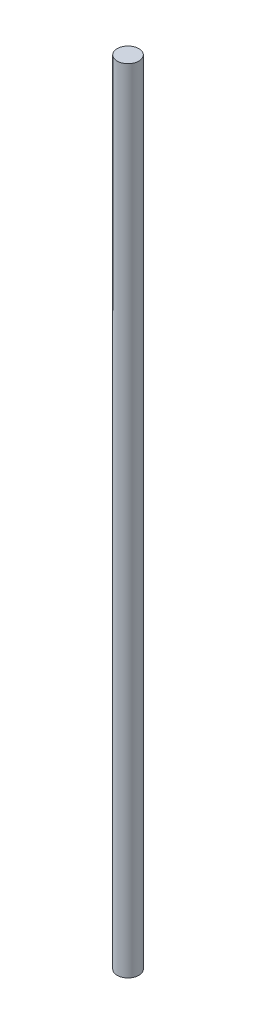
ISO-10303-21;
HEADER;
FILE_DESCRIPTION(('STEP AP214'),'2;1');
FILE_NAME('part.step','',(''),(''),'','','');
FILE_SCHEMA(('AUTOMOTIVE_DESIGN { 1 0 10303 214 1 1 1 1 }'));
ENDSEC;
DATA;
#1=APPLICATION_CONTEXT('core data for automotive mechanical design processes');
#2=APPLICATION_PROTOCOL_DEFINITION('international standard','automotive_design',2000,#1);
#3=PRODUCT_CONTEXT('',#1,'mechanical');
#4=PRODUCT('Part','Part','',(#3));
#5=PRODUCT_RELATED_PRODUCT_CATEGORY('part','',(#4));
#6=PRODUCT_DEFINITION_FORMATION('','',#4);
#7=PRODUCT_DEFINITION_CONTEXT('part definition',#1,'design');
#8=PRODUCT_DEFINITION('design','',#6,#7);
#9=PRODUCT_DEFINITION_SHAPE('','',#8);
#10=(LENGTH_UNIT() NAMED_UNIT(*) SI_UNIT(.MILLI.,.METRE.));
#11=(NAMED_UNIT(*) PLANE_ANGLE_UNIT() SI_UNIT($,.RADIAN.));
#12=(NAMED_UNIT(*) SI_UNIT($,.STERADIAN.) SOLID_ANGLE_UNIT());
#13=UNCERTAINTY_MEASURE_WITH_UNIT(LENGTH_MEASURE(1.E-05),#10,'distance_accuracy_value','');
#14=(GEOMETRIC_REPRESENTATION_CONTEXT(3) GLOBAL_UNCERTAINTY_ASSIGNED_CONTEXT((#13)) GLOBAL_UNIT_ASSIGNED_CONTEXT((#10,
#11,#12)) REPRESENTATION_CONTEXT('',''));
#15=CARTESIAN_POINT('',(0.,0.,0.));
#16=DIRECTION('',(0.,0.,1.));
#17=DIRECTION('',(1.,0.,0.));
#18=AXIS2_PLACEMENT_3D('',#15,#16,#17);
#19=CARTESIAN_POINT('',(0.,365.6,0.));
#20=DIRECTION('',(0.,-1.,0.));
#21=DIRECTION('',(0.,0.,-1.));
#22=AXIS2_PLACEMENT_3D('',#19,#20,#21);
#23=CYLINDRICAL_SURFACE('',#22,5.);
#24=CARTESIAN_POINT('',(0.,365.6,0.));
#25=DIRECTION('',(0.,1.,0.));
#26=DIRECTION('',(0.,0.,1.));
#27=AXIS2_PLACEMENT_3D('',#24,#25,#26);
#28=CIRCLE('',#27,5.);
#29=CARTESIAN_POINT('',(0.,365.6,-5.));
#30=VERTEX_POINT('',#29);
#31=EDGE_CURVE('E10',#30,#30,#28,.T.);
#32=CARTESIAN_POINT('',(0.,0.,0.));
#33=DIRECTION('',(0.,1.,0.));
#34=DIRECTION('',(0.,0.,1.));
#35=AXIS2_PLACEMENT_3D('',#32,#33,#34);
#36=CIRCLE('',#35,5.);
#37=CARTESIAN_POINT('',(0.,0.,-5.));
#38=VERTEX_POINT('',#37);
#39=EDGE_CURVE('E46',#38,#38,#36,.T.);
#40=CARTESIAN_POINT('',(0.,365.6,-5.));
#41=CARTESIAN_POINT('',(0.,361.791666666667,-5.));
#42=CARTESIAN_POINT('',(0.,357.983333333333,-5.));
#43=CARTESIAN_POINT('',(0.,350.366666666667,-5.));
#44=CARTESIAN_POINT('',(0.,346.558333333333,-5.));
#45=CARTESIAN_POINT('',(0.,338.941666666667,-5.));
#46=CARTESIAN_POINT('',(0.,335.133333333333,-5.));
#47=CARTESIAN_POINT('',(0.,327.516666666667,-5.));
#48=CARTESIAN_POINT('',(0.,323.708333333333,-5.));
#49=CARTESIAN_POINT('',(0.,316.091666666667,-5.));
#50=CARTESIAN_POINT('',(0.,312.283333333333,-5.));
#51=CARTESIAN_POINT('',(0.,304.666666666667,-5.));
#52=CARTESIAN_POINT('',(0.,300.858333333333,-5.));
#53=CARTESIAN_POINT('',(0.,293.241666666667,-5.));
#54=CARTESIAN_POINT('',(0.,289.433333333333,-5.));
#55=CARTESIAN_POINT('',(0.,281.816666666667,-5.));
#56=CARTESIAN_POINT('',(0.,278.008333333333,-5.));
#57=CARTESIAN_POINT('',(0.,270.391666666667,-5.));
#58=CARTESIAN_POINT('',(0.,266.583333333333,-5.));
#59=CARTESIAN_POINT('',(0.,258.966666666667,-5.));
#60=CARTESIAN_POINT('',(0.,255.158333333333,-5.));
#61=CARTESIAN_POINT('',(0.,247.541666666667,-5.));
#62=CARTESIAN_POINT('',(0.,243.733333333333,-5.));
#63=CARTESIAN_POINT('',(0.,236.116666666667,-5.));
#64=CARTESIAN_POINT('',(0.,232.308333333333,-5.));
#65=CARTESIAN_POINT('',(0.,224.691666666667,-5.));
#66=CARTESIAN_POINT('',(0.,220.883333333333,-5.));
#67=CARTESIAN_POINT('',(0.,213.266666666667,-5.));
#68=CARTESIAN_POINT('',(0.,209.458333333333,-5.));
#69=CARTESIAN_POINT('',(0.,201.841666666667,-5.));
#70=CARTESIAN_POINT('',(0.,198.033333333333,-5.));
#71=CARTESIAN_POINT('',(0.,190.416666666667,-5.));
#72=CARTESIAN_POINT('',(0.,186.608333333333,-5.));
#73=CARTESIAN_POINT('',(0.,178.991666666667,-5.));
#74=CARTESIAN_POINT('',(0.,175.183333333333,-5.));
#75=CARTESIAN_POINT('',(0.,167.566666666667,-5.));
#76=CARTESIAN_POINT('',(0.,163.758333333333,-5.));
#77=CARTESIAN_POINT('',(0.,156.141666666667,-5.));
#78=CARTESIAN_POINT('',(0.,152.333333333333,-5.));
#79=CARTESIAN_POINT('',(0.,144.716666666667,-5.));
#80=CARTESIAN_POINT('',(0.,140.908333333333,-5.));
#81=CARTESIAN_POINT('',(0.,133.291666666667,-5.));
#82=CARTESIAN_POINT('',(0.,129.483333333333,-5.));
#83=CARTESIAN_POINT('',(0.,121.866666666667,-5.));
#84=CARTESIAN_POINT('',(0.,118.058333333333,-5.));
#85=CARTESIAN_POINT('',(0.,110.441666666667,-5.));
#86=CARTESIAN_POINT('',(0.,106.633333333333,-5.));
#87=CARTESIAN_POINT('',(0.,99.0166666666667,-5.));
#88=CARTESIAN_POINT('',(0.,95.2083333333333,-5.));
#89=CARTESIAN_POINT('',(0.,87.5916666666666,-5.));
#90=CARTESIAN_POINT('',(0.,83.7833333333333,-5.));
#91=CARTESIAN_POINT('',(0.,76.1666666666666,-5.));
#92=CARTESIAN_POINT('',(0.,72.3583333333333,-5.));
#93=CARTESIAN_POINT('',(0.,64.7416666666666,-5.));
#94=CARTESIAN_POINT('',(0.,60.9333333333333,-5.));
#95=CARTESIAN_POINT('',(0.,53.3166666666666,-5.));
#96=CARTESIAN_POINT('',(0.,49.5083333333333,-5.));
#97=CARTESIAN_POINT('',(0.,41.8916666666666,-5.));
#98=CARTESIAN_POINT('',(0.,38.0833333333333,-5.));
#99=CARTESIAN_POINT('',(0.,30.4666666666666,-5.));
#100=CARTESIAN_POINT('',(0.,26.6583333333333,-5.));
#101=CARTESIAN_POINT('',(0.,19.0416666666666,-5.));
#102=CARTESIAN_POINT('',(0.,15.2333333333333,-5.));
#103=CARTESIAN_POINT('',(0.,7.61666666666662,-5.));
#104=CARTESIAN_POINT('',(0.,3.80833333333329,-5.));
#105=CARTESIAN_POINT('',(0.,0.,-5.));
#106=B_SPLINE_CURVE_WITH_KNOTS('',3,(#40,#41,#42,#43,#44,#45,#46,#47,#48,#49,#50,#51,#52,#53,
#54,#55,#56,#57,#58,#59,#60,#61,#62,#63,#64,#65,#66,#67,#68,#69,#70,#71,#72,#73,#74,#75,#76,#77,
#78,#79,#80,#81,#82,#83,#84,#85,#86,#87,#88,#89,#90,#91,#92,#93,#94,#95,#96,#97,#98,#99,#100,
#101,#102,#103,#104,#105),.UNSPECIFIED.,.F.,.F.,(4,2,2,2,2,2,2,2,2,2,2,2,2,2,2,2,2,2,2,2,2,2,2,
2,2,2,2,2,2,2,2,2,4),(0.,11.425,22.85,34.2750000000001,45.7,57.125,68.5500000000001,79.975,91.4,
102.825,114.25,125.675,137.1,148.525,159.95,171.375,182.8,194.225,205.65,217.075,228.5,239.925,
251.35,262.775,274.2,285.625,297.05,308.475,319.9,331.325,342.75,354.175,365.6),.UNSPECIFIED.);
#107=EDGE_CURVE('BSEAM43',#30,#38,#106,.T.);
#108=ORIENTED_EDGE('',*,*,#31,.F.);
#109=ORIENTED_EDGE('',*,*,#39,.T.);
#110=ORIENTED_EDGE('',*,*,#107,.T.);
#111=ORIENTED_EDGE('',*,*,#107,.F.);
#112=EDGE_LOOP('',(#108,#110,#109,#111));
#113=FACE_BOUND('',#112,.T.);
#114=ADVANCED_FACE('F43',(#113),#23,.T.);
#115=CARTESIAN_POINT('',(0.,365.6,0.));
#116=DIRECTION('',(0.,1.,0.));
#117=DIRECTION('',(0.,0.,1.));
#118=AXIS2_PLACEMENT_3D('',#115,#116,#117);
#119=PLANE('',#118);
#120=ORIENTED_EDGE('',*,*,#31,.T.);
#121=EDGE_LOOP('',(#120));
#122=FACE_BOUND('',#121,.T.);
#123=ADVANCED_FACE('F60',(#122),#119,.T.);
#124=CARTESIAN_POINT('',(0.,0.,0.));
#125=DIRECTION('',(0.,1.,0.));
#126=DIRECTION('',(0.,0.,1.));
#127=AXIS2_PLACEMENT_3D('',#124,#125,#126);
#128=PLANE('',#127);
#129=ORIENTED_EDGE('',*,*,#39,.F.);
#130=EDGE_LOOP('',(#129));
#131=FACE_BOUND('',#130,.T.);
#132=ADVANCED_FACE('F58',(#131),#128,.F.);
#133=CLOSED_SHELL('',(#114,#123,#132));
#134=MANIFOLD_SOLID_BREP('B2',#133);
#135=ADVANCED_BREP_SHAPE_REPRESENTATION('',(#18,#134),#14);
#136=SHAPE_DEFINITION_REPRESENTATION(#9,#135);
ENDSEC;
END-ISO-10303-21;
